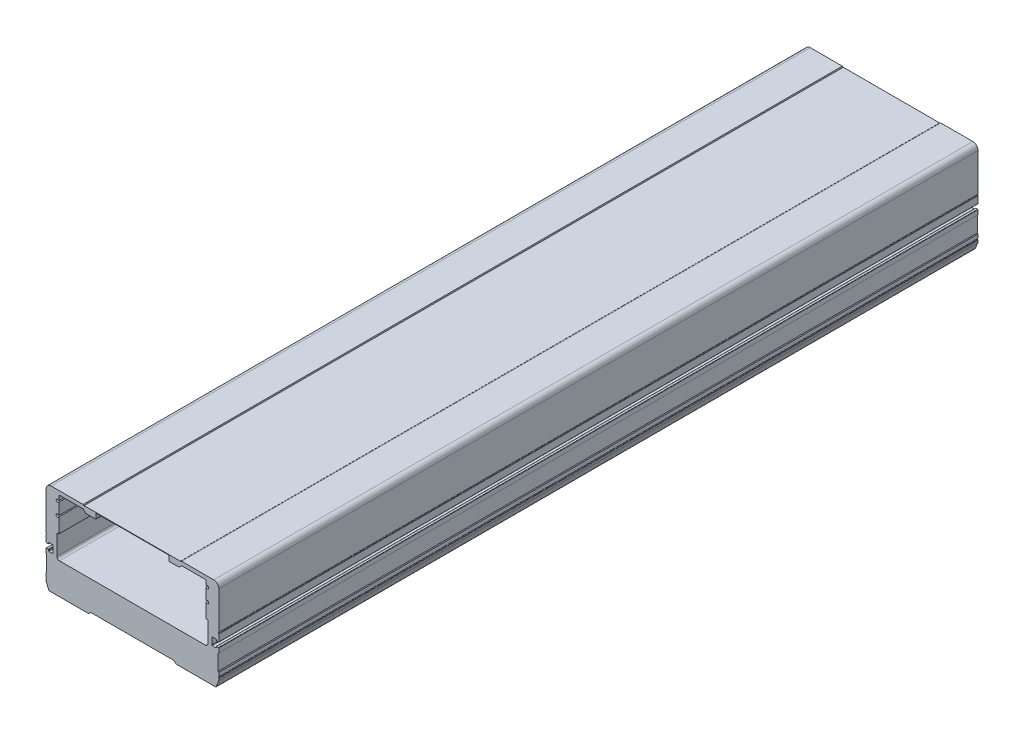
from build123d import *

# Parameters (mm, degrees)
EXTRUDE_1_DEPTH        = 593
HOLE_WIZARD_M6_1_D     = 5
HOLE_WIZARD_M6_1_DEPTH = 12
HOLE_WIZARD_M6_1_TIP   = 1.502151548


with BuildPart() as part:
    # Sketch 1 → Extrude 1 (new body)
    with BuildSketch(Plane.XY):
        with BuildLine():
            Line((-67.5, 66.1), (-67.5, 36.604669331))
            ThreePointArc((-67.5, 36.604669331), (-67.454950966, 36.446555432), (-67.3333333, 36.33592739))
            ThreePointArc((-67.3333333, 36.33592739), (-67.125, 35.999999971), (-67.333333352, 35.664072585))
            ThreePointArc((-67.333333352, 35.664072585), (-67.454950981, 35.553444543), (-67.5, 35.395330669))
            Line((-67.5, 35.395330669), (-67.5, 30.1))
            ThreePointArc((-67.5, 30.1), (-67.412132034, 29.887867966), (-67.2, 29.8))
            Line((-67.2, 29.8), (-65.8, 29.8))
            ThreePointArc((-65.8, 29.8), (-65.587867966, 29.887867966), (-65.5, 30.1))
            Line((-65.5, 30.1), (-65.5, 30.7))
            ThreePointArc((-65.5, 30.7), (-65.412132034, 30.912132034), (-65.2, 31))
            Line((-65.2, 31), (-62.3, 31))
            ThreePointArc((-62.3, 31), (-62.087867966, 30.912132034), (-62, 30.7))
            Line((-62, 30.7), (-62, 25.3))
            ThreePointArc((-62, 25.3), (-62.087867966, 25.087867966), (-62.3, 25))
            Line((-62.3, 25), (-65.2, 25))
            ThreePointArc((-65.2, 25), (-65.412132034, 25.087867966), (-65.5, 25.3))
            Line((-65.5, 25.3), (-65.5, 25.9))
            ThreePointArc((-65.5, 25.9), (-65.587867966, 26.112132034), (-65.8, 26.2))
            Line((-65.8, 26.2), (-67.2, 26.2))
            ThreePointArc((-67.2, 26.2), (-67.412132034, 26.112132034), (-67.5, 25.9))
            Line((-67.5, 25.9), (-67.5, 22.5))
            Line((-67.5, 22.5), (-67, 22))
            Line((-67, 22), (-67, 10))
            Line((-67, 10), (-67.5, 9.5))
            Line((-67.5, 9.5), (-67.5, 6.604669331))
            ThreePointArc((-67.5, 6.604669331), (-67.454950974, 6.446555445), (-67.333333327, 6.335927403))
            ThreePointArc((-67.333333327, 6.335927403), (-67.125, 5.999999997), (-67.333333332, 5.664072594))
            ThreePointArc((-67.333333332, 5.664072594), (-67.454950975, 5.553444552), (-67.5, 5.395330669))
            Line((-67.5, 5.395330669), (-67.5, 4.381968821))
            ThreePointArc((-67.5, 4.381968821), (-67.464493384, 4.00678121), (-67.359234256, 3.644915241))
            Line((-67.359234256, 3.644915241), (-65.506419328, -1.028852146))
            ThreePointArc((-65.506419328, -1.028852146), (-65.35722349, -1.328991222), (-65.16, -1.6))
            Line((-65.16, -1.6), (-34.1, -1.6))
            Line((-34.1, -1.6), (-32.5, 0))
            Line((-32.5, 0), (32.5, 0))
            Line((32.5, 0), (34.1, -1.6))
            Line((34.1, -1.6), (65.16, -1.6))
            ThreePointArc((65.16, -1.6), (65.35722349, -1.328991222), (65.506419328, -1.028852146))
            Line((65.506419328, -1.028852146), (67.359234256, 3.644915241))
            ThreePointArc((67.359234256, 3.644915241), (67.464493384, 4.00678121), (67.5, 4.381968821))
            Line((67.5, 4.381968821), (67.5, 5.395330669))
            ThreePointArc((67.5, 5.395330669), (67.454950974, 5.553444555), (67.333333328, 5.664072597))
            ThreePointArc((67.333333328, 5.664072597), (67.125, 6.000000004), (67.333333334, 6.335927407))
            ThreePointArc((67.333333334, 6.335927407), (67.454950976, 6.446555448), (67.5, 6.604669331))
            Line((67.5, 6.604669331), (67.5, 9.5))
            Line((67.5, 9.5), (67, 10))
            Line((67, 10), (67, 22))
            Line((67, 22), (67.5, 22.5))
            Line((67.5, 22.5), (67.5, 25.9))
            ThreePointArc((67.5, 25.9), (67.412132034, 26.112132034), (67.2, 26.2))
            Line((67.2, 26.2), (65.8, 26.2))
            ThreePointArc((65.8, 26.2), (65.587867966, 26.112132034), (65.5, 25.9))
            Line((65.5, 25.9), (65.5, 25.3))
            ThreePointArc((65.5, 25.3), (65.412132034, 25.087867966), (65.2, 25))
            Line((65.2, 25), (62.3, 25))
            ThreePointArc((62.3, 25), (62.087867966, 25.087867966), (62, 25.3))
            Line((62, 25.3), (62, 30.7))
            ThreePointArc((62, 30.7), (62.087867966, 30.912132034), (62.3, 31))
            Line((62.3, 31), (65.2, 31))
            ThreePointArc((65.2, 31), (65.412132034, 30.912132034), (65.5, 30.7))
            Line((65.5, 30.7), (65.5, 30.1))
            ThreePointArc((65.5, 30.1), (65.587867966, 29.887867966), (65.8, 29.8))
            Line((65.8, 29.8), (67.2, 29.8))
            ThreePointArc((67.2, 29.8), (67.412132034, 29.887867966), (67.5, 30.1))
            Line((67.5, 30.1), (67.5, 35.395330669))
            ThreePointArc((67.5, 35.395330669), (67.454950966, 35.553444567), (67.333333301, 35.66407261))
            ThreePointArc((67.333333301, 35.66407261), (67.125, 36.000000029), (67.333333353, 36.335927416))
            ThreePointArc((67.333333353, 36.335927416), (67.454950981, 36.446555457), (67.5, 36.604669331))
            Line((67.5, 36.604669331), (67.5, 66.1))
            ThreePointArc((67.5, 66.1), (66.328427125, 68.928427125), (63.5, 70.1))
            Line((63.5, 70.1), (38.5, 70.1))
            Line((38.5, 70.1), (38, 69.6))
            Line((38, 69.6), (37.5, 69.6))
            Line((37.5, 69.6), (37.5, 69.7))
            Line((37.5, 69.7), (-37.5, 69.7))
            Line((-37.5, 69.7), (-37.5, 69.6))
            Line((-37.5, 69.6), (-38, 69.6))
            Line((-38, 69.6), (-38.5, 70.1))
            Line((-38.5, 70.1), (-63.5, 70.1))
            ThreePointArc((-63.5, 70.1), (-66.328427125, 68.928427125), (-67.5, 66.1))
        make_face()
        with BuildLine():
            Line((-57, 22.7), (57, 22.7))
            ThreePointArc((57, 22.7), (58.414213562, 23.285786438), (59, 24.7))
            Line((59, 24.7), (59, 40.6))
            Line((59, 40.6), (57.5, 40.6))
            Line((57.5, 40.6), (57.5, 52.141742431))
            ThreePointArc((57.5, 52.141742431), (59.6, 52.6), (57.5, 53.058257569))
            Line((57.5, 53.058257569), (57.5, 62.141742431))
            ThreePointArc((57.5, 62.141742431), (59.6, 62.6), (57.5, 63.058257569))
            Line((57.5, 63.058257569), (57.5, 66.1))
            ThreePointArc((57.5, 66.1), (57.207106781, 66.807106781), (56.5, 67.1))
            Line((56.5, 67.1), (38.5, 67.1))
            Line((38.5, 67.1), (36.5, 65.1))
            Line((36.5, 65.1), (28.8, 65.1))
            ThreePointArc((28.8, 65.1), (28.587867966, 65.187867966), (28.5, 65.4))
            Line((28.5, 65.4), (28.5, 69.3))
            Line((28.5, 69.3), (-28.5, 69.3))
            Line((-28.5, 69.3), (-28.5, 65.4))
            ThreePointArc((-28.5, 65.4), (-28.587867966, 65.187867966), (-28.8, 65.1))
            Line((-28.8, 65.1), (-36.5, 65.1))
            Line((-36.5, 65.1), (-38.5, 67.1))
            Line((-38.5, 67.1), (-56.5, 67.1))
            ThreePointArc((-56.5, 67.1), (-57.207106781, 66.807106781), (-57.5, 66.1))
            Line((-57.5, 66.1), (-57.5, 63.058257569))
            ThreePointArc((-57.5, 63.058257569), (-59.6, 62.6), (-57.5, 62.141742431))
            Line((-57.5, 62.141742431), (-57.5, 53.058257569))
            ThreePointArc((-57.5, 53.058257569), (-59.6, 52.6), (-57.5, 52.141742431))
            Line((-57.5, 52.141742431), (-57.5, 40.6))
            Line((-57.5, 40.6), (-59.3, 40.6))
            ThreePointArc((-59.3, 40.6), (-59.087867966, 40.512132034), (-59, 40.3))
            Line((-59, 40.3), (-59, 24.7))
            ThreePointArc((-59, 24.7), (-58.414213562, 23.285786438), (-57, 22.7))
        make_face(mode=Mode.SUBTRACT)
    extrude(amount=EXTRUDE_1_DEPTH)

    # Hole Wizard M6 _1
    with Locations(Plane(origin=(0, -1.6, 0), x_dir=(-1, 0, 0), z_dir=(0, -1, 0))):
        with Locations((53, -541.5), (-53, -541.5), (53, -441.5), (53, -241.5), (53, -41.5), (53, 158.5), (53, 358.5), (53, 558.5), (-53, 358.5), (-53, 158.5), (-53, -41.5), (-53, -241.5), (-53, -441.5), (-53, 558.5)):
            Hole(HOLE_WIZARD_M6_1_D / 2, depth=HOLE_WIZARD_M6_1_DEPTH)
            with Locations((0, 0, -(HOLE_WIZARD_M6_1_DEPTH + HOLE_WIZARD_M6_1_TIP / 2))):  # 118° drill point
                Cone(0, HOLE_WIZARD_M6_1_D / 2, HOLE_WIZARD_M6_1_TIP, mode=Mode.SUBTRACT)


solid = part.part
